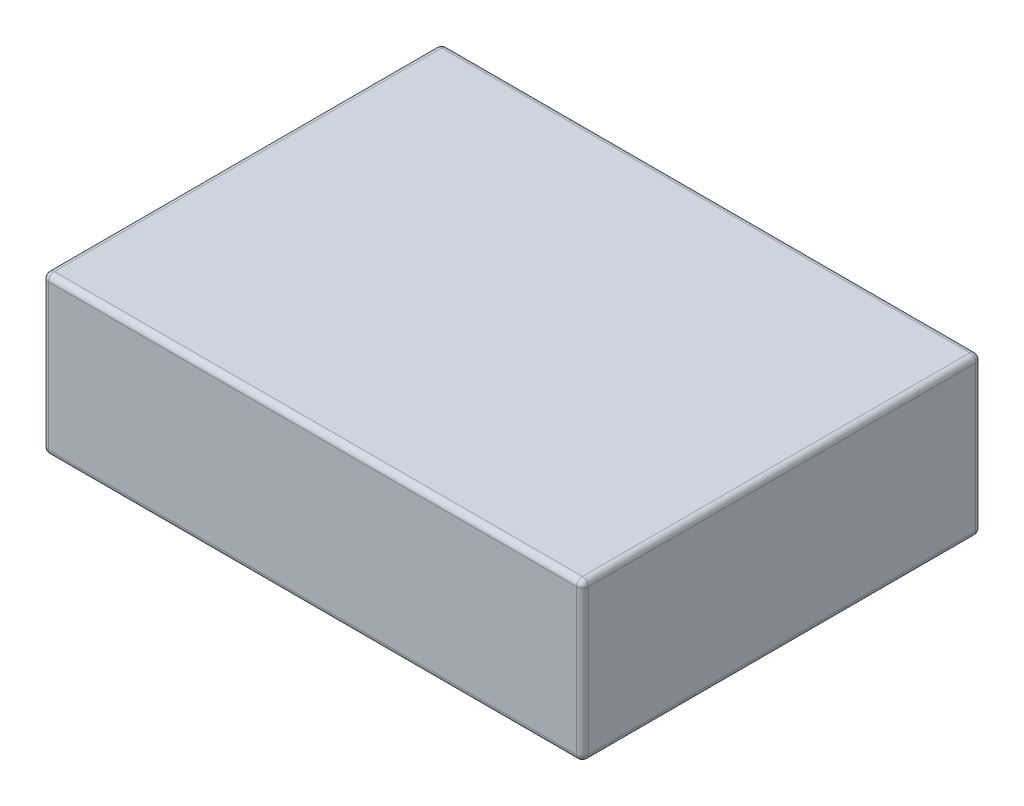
from build123d import *

# Parameters (mm, degrees)
SKETCH1_W           = 23
SKETCH1_H           = 17
BOSS_EXTRUDE1_DEPTH = 6.7
FILLET1_R           = 0.25


with BuildPart() as part:
    # Sketch1 → Boss-Extrude1 (new body)
    with BuildSketch(Plane(origin=(0, 0, 0), x_dir=(1, 0, 0), z_dir=(0, 1, 0))):
        with Locations((11.5, 8.5)):
            Rectangle(SKETCH1_W, SKETCH1_H)
    extrude(amount=BOSS_EXTRUDE1_DEPTH)

    # Fillet1
    fillet1_edges = [part.edges().sort_by_distance(p)[0] for p in [
        (23, 6.7, -8.5),
        (11.5, 6.7, -17),
        (0, 6.7, -8.5),
        (11.5, 0, -17),
        (23, 0, -8.5),
        (11.5, 0, 0),
        (0, 0, -8.5),
        (11.5, 6.7, 0),
        (0, 3.35, -17),
        (23, 3.35, -17),
        (23, 3.35, 0),
        (0, 3.35, 0),
    ]]
    fillet(fillet1_edges, radius=FILLET1_R)


solid = part.part
